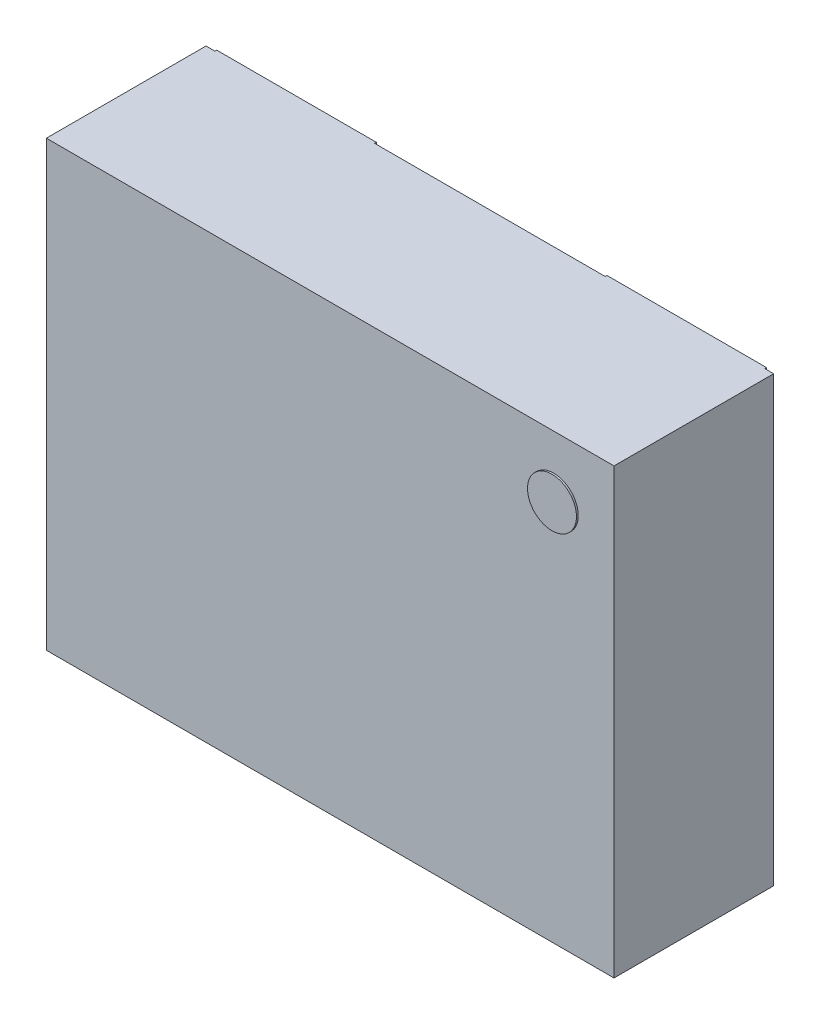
ISO-10303-21;
HEADER;
FILE_DESCRIPTION(('STEP AP214'),'2;1');
FILE_NAME('part.step','',(''),(''),'','','');
FILE_SCHEMA(('AUTOMOTIVE_DESIGN { 1 0 10303 214 1 1 1 1 }'));
ENDSEC;
DATA;
#1=APPLICATION_CONTEXT('core data for automotive mechanical design processes');
#2=APPLICATION_PROTOCOL_DEFINITION('international standard','automotive_design',2000,#1);
#3=PRODUCT_CONTEXT('',#1,'mechanical');
#4=PRODUCT('Part','Part','',(#3));
#5=PRODUCT_RELATED_PRODUCT_CATEGORY('part','',(#4));
#6=PRODUCT_DEFINITION_FORMATION('','',#4);
#7=PRODUCT_DEFINITION_CONTEXT('part definition',#1,'design');
#8=PRODUCT_DEFINITION('design','',#6,#7);
#9=PRODUCT_DEFINITION_SHAPE('','',#8);
#10=(LENGTH_UNIT() NAMED_UNIT(*) SI_UNIT(.MILLI.,.METRE.));
#11=(NAMED_UNIT(*) PLANE_ANGLE_UNIT() SI_UNIT($,.RADIAN.));
#12=(NAMED_UNIT(*) SI_UNIT($,.STERADIAN.) SOLID_ANGLE_UNIT());
#13=UNCERTAINTY_MEASURE_WITH_UNIT(LENGTH_MEASURE(1.E-05),#10,'distance_accuracy_value','');
#14=(GEOMETRIC_REPRESENTATION_CONTEXT(3) GLOBAL_UNCERTAINTY_ASSIGNED_CONTEXT((#13)) GLOBAL_UNIT_ASSIGNED_CONTEXT((#10,
#11,#12)) REPRESENTATION_CONTEXT('',''));
#15=CARTESIAN_POINT('',(0.,0.,0.));
#16=DIRECTION('',(0.,0.,1.));
#17=DIRECTION('',(1.,0.,0.));
#18=AXIS2_PLACEMENT_3D('',#15,#16,#17);
#19=CARTESIAN_POINT('',(7.35489990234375,20.14,-0.01));
#20=DIRECTION('',(0.,-1.,0.));
#21=DIRECTION('',(1.,0.,0.));
#22=AXIS2_PLACEMENT_3D('',#19,#20,#21);
#23=PLANE('',#22);
#24=DIRECTION('',(0.,0.,1.));
#25=VECTOR('',#24,1.);
#26=CARTESIAN_POINT('',(7.35489990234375,20.14,-0.0100000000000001));
#27=LINE('',#26,#25);
#28=CARTESIAN_POINT('',(7.35489990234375,20.14,0.));
#29=VERTEX_POINT('',#28);
#30=CARTESIAN_POINT('',(7.35489990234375,20.14,-0.01));
#31=VERTEX_POINT('',#30);
#32=EDGE_CURVE('E167',#29,#31,#27,.F.);
#33=ORIENTED_EDGE('',*,*,#32,.T.);
#34=DIRECTION('',(1.,0.,0.));
#35=VECTOR('',#34,1.);
#36=CARTESIAN_POINT('',(6.45489990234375,20.14,-0.0100000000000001));
#37=LINE('',#36,#35);
#38=CARTESIAN_POINT('',(6.45489990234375,20.14,-0.0100000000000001));
#39=VERTEX_POINT('',#38);
#40=EDGE_CURVE('E157',#39,#31,#37,.T.);
#41=ORIENTED_EDGE('',*,*,#40,.F.);
#42=DIRECTION('',(0.,0.,1.));
#43=VECTOR('',#42,1.);
#44=CARTESIAN_POINT('',(6.45489990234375,20.14,-0.0100000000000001));
#45=LINE('',#44,#43);
#46=CARTESIAN_POINT('',(6.45489990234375,20.14,0.));
#47=VERTEX_POINT('',#46);
#48=EDGE_CURVE('E180',#39,#47,#45,.T.);
#49=ORIENTED_EDGE('',*,*,#48,.T.);
#50=DIRECTION('',(1.,0.,0.));
#51=VECTOR('',#50,1.);
#52=CARTESIAN_POINT('',(7.40489990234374,20.14,0.));
#53=LINE('',#52,#51);
#54=EDGE_CURVE('E170',#29,#47,#53,.F.);
#55=ORIENTED_EDGE('',*,*,#54,.F.);
#56=EDGE_LOOP('',(#33,#41,#49,#55));
#57=FACE_BOUND('',#56,.T.);
#58=ADVANCED_FACE('F16',(#57),#23,.F.);
#59=CARTESIAN_POINT('',(4.25489990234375,20.14,-0.01));
#60=DIRECTION('',(0.,-1.,0.));
#61=DIRECTION('',(1.,0.,0.));
#62=AXIS2_PLACEMENT_3D('',#59,#60,#61);
#63=PLANE('',#62);
#64=DIRECTION('',(0.,0.,1.));
#65=VECTOR('',#64,1.);
#66=CARTESIAN_POINT('',(5.15489990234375,20.14,-0.0100000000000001));
#67=LINE('',#66,#65);
#68=CARTESIAN_POINT('',(5.15489990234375,20.14,0.));
#69=VERTEX_POINT('',#68);
#70=CARTESIAN_POINT('',(5.15489990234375,20.14,-0.01));
#71=VERTEX_POINT('',#70);
#72=EDGE_CURVE('E263',#69,#71,#67,.F.);
#73=ORIENTED_EDGE('',*,*,#72,.T.);
#74=DIRECTION('',(1.,0.,0.));
#75=VECTOR('',#74,1.);
#76=CARTESIAN_POINT('',(4.25489990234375,20.14,-0.01));
#77=LINE('',#76,#75);
#78=CARTESIAN_POINT('',(4.25489990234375,20.14,-0.01));
#79=VERTEX_POINT('',#78);
#80=EDGE_CURVE('E261',#79,#71,#77,.T.);
#81=ORIENTED_EDGE('',*,*,#80,.F.);
#82=DIRECTION('',(0.,0.,1.));
#83=VECTOR('',#82,1.);
#84=CARTESIAN_POINT('',(4.25489990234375,20.14,-0.0100000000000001));
#85=LINE('',#84,#83);
#86=CARTESIAN_POINT('',(4.25489990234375,20.14,0.));
#87=VERTEX_POINT('',#86);
#88=EDGE_CURVE('E253',#79,#87,#85,.T.);
#89=ORIENTED_EDGE('',*,*,#88,.T.);
#90=DIRECTION('',(1.,0.,0.));
#91=VECTOR('',#90,1.);
#92=CARTESIAN_POINT('',(7.40489990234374,20.14,0.));
#93=LINE('',#92,#91);
#94=EDGE_CURVE('E221',#69,#87,#93,.F.);
#95=ORIENTED_EDGE('',*,*,#94,.F.);
#96=EDGE_LOOP('',(#73,#81,#89,#95));
#97=FACE_BOUND('',#96,.T.);
#98=ADVANCED_FACE('F356',(#97),#63,.F.);
#99=CARTESIAN_POINT('',(4.25489990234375,21.04,-0.00999999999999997));
#100=DIRECTION('',(0.,1.,0.));
#101=DIRECTION('',(-1.,0.,0.));
#102=AXIS2_PLACEMENT_3D('',#99,#100,#101);
#103=PLANE('',#102);
#104=DIRECTION('',(0.,0.,1.));
#105=VECTOR('',#104,1.);
#106=CARTESIAN_POINT('',(4.25489990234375,21.04,-0.00999999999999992));
#107=LINE('',#106,#105);
#108=CARTESIAN_POINT('',(4.25489990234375,21.04,0.));
#109=VERTEX_POINT('',#108);
#110=CARTESIAN_POINT('',(4.25489990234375,21.04,-0.00999999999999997));
#111=VERTEX_POINT('',#110);
#112=EDGE_CURVE('E250',#109,#111,#107,.F.);
#113=ORIENTED_EDGE('',*,*,#112,.T.);
#114=DIRECTION('',(1.,0.,0.));
#115=VECTOR('',#114,1.);
#116=CARTESIAN_POINT('',(5.15489990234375,21.04,-0.00999999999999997));
#117=LINE('',#116,#115);
#118=CARTESIAN_POINT('',(5.15489990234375,21.04,-0.00999999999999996));
#119=VERTEX_POINT('',#118);
#120=EDGE_CURVE('E248',#119,#111,#117,.F.);
#121=ORIENTED_EDGE('',*,*,#120,.F.);
#122=DIRECTION('',(0.,0.,1.));
#123=VECTOR('',#122,1.);
#124=CARTESIAN_POINT('',(5.15489990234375,21.04,-0.00999999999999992));
#125=LINE('',#124,#123);
#126=CARTESIAN_POINT('',(5.15489990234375,21.04,0.));
#127=VERTEX_POINT('',#126);
#128=EDGE_CURVE('E240',#119,#127,#125,.T.);
#129=ORIENTED_EDGE('',*,*,#128,.T.);
#130=DIRECTION('',(1.,0.,0.));
#131=VECTOR('',#130,1.);
#132=CARTESIAN_POINT('',(7.40489990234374,21.04,0.));
#133=LINE('',#132,#131);
#134=EDGE_CURVE('E214',#109,#127,#133,.T.);
#135=ORIENTED_EDGE('',*,*,#134,.F.);
#136=EDGE_LOOP('',(#113,#121,#129,#135));
#137=FACE_BOUND('',#136,.T.);
#138=ADVANCED_FACE('F383',(#137),#103,.F.);
#139=CARTESIAN_POINT('',(6.90489990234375,21.04,-0.00999999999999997));
#140=DIRECTION('',(0.,1.,0.));
#141=DIRECTION('',(0.,0.,1.));
#142=AXIS2_PLACEMENT_3D('',#139,#140,#141);
#143=PLANE('',#142);
#144=DIRECTION('',(0.,0.,1.));
#145=VECTOR('',#144,1.);
#146=CARTESIAN_POINT('',(6.45489990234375,21.04,-0.00999999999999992));
#147=LINE('',#146,#145);
#148=CARTESIAN_POINT('',(6.45489990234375,21.04,0.));
#149=VERTEX_POINT('',#148);
#150=CARTESIAN_POINT('',(6.45489990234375,21.04,-0.00999999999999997));
#151=VERTEX_POINT('',#150);
#152=EDGE_CURVE('E238',#149,#151,#147,.F.);
#153=ORIENTED_EDGE('',*,*,#152,.T.);
#154=DIRECTION('',(1.,0.,0.));
#155=VECTOR('',#154,1.);
#156=CARTESIAN_POINT('',(7.35489990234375,21.04,-0.00999999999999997));
#157=LINE('',#156,#155);
#158=CARTESIAN_POINT('',(6.90489990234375,21.04,-0.00999999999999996));
#159=VERTEX_POINT('',#158);
#160=EDGE_CURVE('E192',#159,#151,#157,.F.);
#161=ORIENTED_EDGE('',*,*,#160,.F.);
#162=DIRECTION('',(0.,0.,1.));
#163=VECTOR('',#162,1.);
#164=CARTESIAN_POINT('',(6.90489990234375,21.04,-0.00999999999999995));
#165=LINE('',#164,#163);
#166=CARTESIAN_POINT('',(6.90489990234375,21.04,0.));
#167=VERTEX_POINT('',#166);
#168=EDGE_CURVE('E173',#159,#167,#165,.T.);
#169=ORIENTED_EDGE('',*,*,#168,.T.);
#170=DIRECTION('',(1.,0.,0.));
#171=VECTOR('',#170,1.);
#172=CARTESIAN_POINT('',(7.40489990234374,21.04,0.));
#173=LINE('',#172,#171);
#174=EDGE_CURVE('E191',#149,#167,#173,.T.);
#175=ORIENTED_EDGE('',*,*,#174,.F.);
#176=EDGE_LOOP('',(#153,#161,#169,#175));
#177=FACE_BOUND('',#176,.T.);
#178=ADVANCED_FACE('F190',(#177),#143,.F.);
#179=CARTESIAN_POINT('',(7.35489990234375,21.44,-0.00999999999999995));
#180=DIRECTION('',(-0.66436383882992,0.74740931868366,0.));
#181=DIRECTION('',(-0.74740931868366,-0.66436383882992,0.));
#182=AXIS2_PLACEMENT_3D('',#179,#180,#181);
#183=PLANE('',#182);
#184=ORIENTED_EDGE('',*,*,#168,.F.);
#185=DIRECTION('',(-0.747409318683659,-0.664363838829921,0.));
#186=VECTOR('',#185,1.);
#187=CARTESIAN_POINT('',(7.35489990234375,21.44,-0.00999999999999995));
#188=LINE('',#187,#186);
#189=CARTESIAN_POINT('',(7.35489990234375,21.44,-0.00999999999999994));
#190=VERTEX_POINT('',#189);
#191=EDGE_CURVE('E236',#190,#159,#188,.T.);
#192=ORIENTED_EDGE('',*,*,#191,.F.);
#193=DIRECTION('',(0.,0.,1.));
#194=VECTOR('',#193,1.);
#195=CARTESIAN_POINT('',(7.35489990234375,21.44,-0.00999999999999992));
#196=LINE('',#195,#194);
#197=CARTESIAN_POINT('',(7.35489990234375,21.44,0.));
#198=VERTEX_POINT('',#197);
#199=EDGE_CURVE('E199',#190,#198,#196,.T.);
#200=ORIENTED_EDGE('',*,*,#199,.T.);
#201=DIRECTION('',(0.747409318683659,0.664363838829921,0.));
#202=VECTOR('',#201,1.);
#203=CARTESIAN_POINT('',(6.90489990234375,21.04,0.));
#204=LINE('',#203,#202);
#205=EDGE_CURVE('E196',#167,#198,#204,.T.);
#206=ORIENTED_EDGE('',*,*,#205,.F.);
#207=EDGE_LOOP('',(#184,#192,#200,#206));
#208=FACE_BOUND('',#207,.T.);
#209=ADVANCED_FACE('F197',(#208),#183,.F.);
#210=CARTESIAN_POINT('',(7.35489990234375,19.34,-0.0100000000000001));
#211=DIRECTION('',(-1.,0.,0.));
#212=DIRECTION('',(0.,-1.,0.));
#213=AXIS2_PLACEMENT_3D('',#210,#211,#212);
#214=PLANE('',#213);
#215=DIRECTION('',(0.,0.,1.));
#216=VECTOR('',#215,1.);
#217=CARTESIAN_POINT('',(7.35489990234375,19.34,0.9));
#218=LINE('',#217,#216);
#219=CARTESIAN_POINT('',(7.35489990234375,19.34,0.));
#220=VERTEX_POINT('',#219);
#221=CARTESIAN_POINT('',(7.35489990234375,19.34,-0.0100000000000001));
#222=VERTEX_POINT('',#221);
#223=EDGE_CURVE('E178',#220,#222,#218,.F.);
#224=ORIENTED_EDGE('',*,*,#223,.T.);
#225=DIRECTION('',(0.,1.,0.));
#226=VECTOR('',#225,1.);
#227=CARTESIAN_POINT('',(7.35489990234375,19.34,-0.0100000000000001));
#228=LINE('',#227,#226);
#229=EDGE_CURVE('E164',#31,#222,#228,.F.);
#230=ORIENTED_EDGE('',*,*,#229,.F.);
#231=ORIENTED_EDGE('',*,*,#32,.F.);
#232=DIRECTION('',(0.,1.,0.));
#233=VECTOR('',#232,1.);
#234=CARTESIAN_POINT('',(7.35489990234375,21.84,0.));
#235=LINE('',#234,#233);
#236=EDGE_CURVE('E204',#220,#29,#235,.T.);
#237=ORIENTED_EDGE('',*,*,#236,.F.);
#238=EDGE_LOOP('',(#224,#230,#231,#237));
#239=FACE_BOUND('',#238,.T.);
#240=ADVANCED_FACE('F176',(#239),#214,.F.);
#241=CARTESIAN_POINT('',(6.45489990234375,19.34,-0.0100000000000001));
#242=DIRECTION('',(0.,0.,-1.));
#243=DIRECTION('',(0.,1.,0.));
#244=AXIS2_PLACEMENT_3D('',#241,#242,#243);
#245=PLANE('',#244);
#246=ORIENTED_EDGE('',*,*,#40,.T.);
#247=ORIENTED_EDGE('',*,*,#229,.T.);
#248=DIRECTION('',(-1.,0.,0.));
#249=VECTOR('',#248,1.);
#250=CARTESIAN_POINT('',(4.20489990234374,19.34,-0.0100000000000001));
#251=LINE('',#250,#249);
#252=CARTESIAN_POINT('',(6.45489990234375,19.34,-0.0100000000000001));
#253=VERTEX_POINT('',#252);
#254=EDGE_CURVE('E286',#222,#253,#251,.T.);
#255=ORIENTED_EDGE('',*,*,#254,.T.);
#256=DIRECTION('',(0.,1.,0.));
#257=VECTOR('',#256,1.);
#258=CARTESIAN_POINT('',(6.45489990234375,19.34,-0.0100000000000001));
#259=LINE('',#258,#257);
#260=EDGE_CURVE('E166',#253,#39,#259,.T.);
#261=ORIENTED_EDGE('',*,*,#260,.T.);
#262=EDGE_LOOP('',(#246,#247,#255,#261));
#263=FACE_BOUND('',#262,.T.);
#264=ADVANCED_FACE('F161',(#263),#245,.T.);
#265=CARTESIAN_POINT('',(6.45489990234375,19.34,-0.0100000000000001));
#266=DIRECTION('',(1.,0.,0.));
#267=DIRECTION('',(0.,1.,0.));
#268=AXIS2_PLACEMENT_3D('',#265,#266,#267);
#269=PLANE('',#268);
#270=ORIENTED_EDGE('',*,*,#48,.F.);
#271=ORIENTED_EDGE('',*,*,#260,.F.);
#272=DIRECTION('',(0.,0.,1.));
#273=VECTOR('',#272,1.);
#274=CARTESIAN_POINT('',(6.45489990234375,19.34,0.9));
#275=LINE('',#274,#273);
#276=CARTESIAN_POINT('',(6.45489990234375,19.34,0.));
#277=VERTEX_POINT('',#276);
#278=EDGE_CURVE('E270',#253,#277,#275,.T.);
#279=ORIENTED_EDGE('',*,*,#278,.T.);
#280=DIRECTION('',(0.,1.,0.));
#281=VECTOR('',#280,1.);
#282=CARTESIAN_POINT('',(6.45489990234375,21.84,0.));
#283=LINE('',#282,#281);
#284=EDGE_CURVE('E226',#47,#277,#283,.F.);
#285=ORIENTED_EDGE('',*,*,#284,.F.);
#286=EDGE_LOOP('',(#270,#271,#279,#285));
#287=FACE_BOUND('',#286,.T.);
#288=ADVANCED_FACE('F268',(#287),#269,.F.);
#289=CARTESIAN_POINT('',(5.15489990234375,19.34,-0.0100000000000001));
#290=DIRECTION('',(-1.,0.,0.));
#291=DIRECTION('',(0.,-1.,0.));
#292=AXIS2_PLACEMENT_3D('',#289,#290,#291);
#293=PLANE('',#292);
#294=DIRECTION('',(0.,0.,1.));
#295=VECTOR('',#294,1.);
#296=CARTESIAN_POINT('',(5.15489990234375,19.34,0.9));
#297=LINE('',#296,#295);
#298=CARTESIAN_POINT('',(5.15489990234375,19.34,0.));
#299=VERTEX_POINT('',#298);
#300=CARTESIAN_POINT('',(5.15489990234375,19.34,-0.01));
#301=VERTEX_POINT('',#300);
#302=EDGE_CURVE('E282',#299,#301,#297,.F.);
#303=ORIENTED_EDGE('',*,*,#302,.T.);
#304=DIRECTION('',(0.,1.,0.));
#305=VECTOR('',#304,1.);
#306=CARTESIAN_POINT('',(5.15489990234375,20.14,-0.01));
#307=LINE('',#306,#305);
#308=EDGE_CURVE('E259',#71,#301,#307,.F.);
#309=ORIENTED_EDGE('',*,*,#308,.F.);
#310=ORIENTED_EDGE('',*,*,#72,.F.);
#311=DIRECTION('',(0.,1.,0.));
#312=VECTOR('',#311,1.);
#313=CARTESIAN_POINT('',(5.15489990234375,21.84,0.));
#314=LINE('',#313,#312);
#315=EDGE_CURVE('E223',#299,#69,#314,.T.);
#316=ORIENTED_EDGE('',*,*,#315,.F.);
#317=EDGE_LOOP('',(#303,#309,#310,#316));
#318=FACE_BOUND('',#317,.T.);
#319=ADVANCED_FACE('F353',(#318),#293,.F.);
#320=CARTESIAN_POINT('',(4.25489990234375,20.14,-0.01));
#321=DIRECTION('',(0.,0.,-1.));
#322=DIRECTION('',(0.,1.,0.));
#323=AXIS2_PLACEMENT_3D('',#320,#321,#322);
#324=PLANE('',#323);
#325=ORIENTED_EDGE('',*,*,#308,.T.);
#326=DIRECTION('',(-1.,0.,0.));
#327=VECTOR('',#326,1.);
#328=CARTESIAN_POINT('',(4.20489990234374,19.34,-0.0100000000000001));
#329=LINE('',#328,#327);
#330=CARTESIAN_POINT('',(4.25489990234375,19.34,-0.0100000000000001));
#331=VERTEX_POINT('',#330);
#332=EDGE_CURVE('E284',#301,#331,#329,.T.);
#333=ORIENTED_EDGE('',*,*,#332,.T.);
#334=DIRECTION('',(0.,1.,0.));
#335=VECTOR('',#334,1.);
#336=CARTESIAN_POINT('',(4.25489990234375,19.34,-0.0100000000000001));
#337=LINE('',#336,#335);
#338=EDGE_CURVE('E256',#331,#79,#337,.T.);
#339=ORIENTED_EDGE('',*,*,#338,.T.);
#340=ORIENTED_EDGE('',*,*,#80,.T.);
#341=EDGE_LOOP('',(#325,#333,#339,#340));
#342=FACE_BOUND('',#341,.T.);
#343=ADVANCED_FACE('F349',(#342),#324,.T.);
#344=CARTESIAN_POINT('',(4.25489990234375,19.34,-0.0100000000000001));
#345=DIRECTION('',(1.,0.,0.));
#346=DIRECTION('',(0.,1.,0.));
#347=AXIS2_PLACEMENT_3D('',#344,#345,#346);
#348=PLANE('',#347);
#349=ORIENTED_EDGE('',*,*,#88,.F.);
#350=ORIENTED_EDGE('',*,*,#338,.F.);
#351=DIRECTION('',(0.,0.,1.));
#352=VECTOR('',#351,1.);
#353=CARTESIAN_POINT('',(4.25489990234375,19.34,0.9));
#354=LINE('',#353,#352);
#355=CARTESIAN_POINT('',(4.25489990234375,19.34,0.));
#356=VERTEX_POINT('',#355);
#357=EDGE_CURVE('E345',#331,#356,#354,.T.);
#358=ORIENTED_EDGE('',*,*,#357,.T.);
#359=DIRECTION('',(0.,1.,0.));
#360=VECTOR('',#359,1.);
#361=CARTESIAN_POINT('',(4.25489990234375,21.84,0.));
#362=LINE('',#361,#360);
#363=EDGE_CURVE('E219',#87,#356,#362,.F.);
#364=ORIENTED_EDGE('',*,*,#363,.F.);
#365=EDGE_LOOP('',(#349,#350,#358,#364));
#366=FACE_BOUND('',#365,.T.);
#367=ADVANCED_FACE('F360',(#366),#348,.F.);
#368=CARTESIAN_POINT('',(4.25489990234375,21.84,-0.00999999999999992));
#369=DIRECTION('',(1.,0.,0.));
#370=DIRECTION('',(0.,1.,0.));
#371=AXIS2_PLACEMENT_3D('',#368,#369,#370);
#372=PLANE('',#371);
#373=DIRECTION('',(0.,0.,1.));
#374=VECTOR('',#373,1.);
#375=CARTESIAN_POINT('',(4.25489990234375,21.84,0.9));
#376=LINE('',#375,#374);
#377=CARTESIAN_POINT('',(4.25489990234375,21.84,0.));
#378=VERTEX_POINT('',#377);
#379=CARTESIAN_POINT('',(4.25489990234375,21.84,-0.00999999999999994));
#380=VERTEX_POINT('',#379);
#381=EDGE_CURVE('E329',#378,#380,#376,.F.);
#382=ORIENTED_EDGE('',*,*,#381,.T.);
#383=DIRECTION('',(0.,1.,0.));
#384=VECTOR('',#383,1.);
#385=CARTESIAN_POINT('',(4.25489990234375,21.84,-0.00999999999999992));
#386=LINE('',#385,#384);
#387=EDGE_CURVE('E246',#111,#380,#386,.T.);
#388=ORIENTED_EDGE('',*,*,#387,.F.);
#389=ORIENTED_EDGE('',*,*,#112,.F.);
#390=DIRECTION('',(0.,1.,0.));
#391=VECTOR('',#390,1.);
#392=CARTESIAN_POINT('',(4.25489990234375,21.84,0.));
#393=LINE('',#392,#391);
#394=EDGE_CURVE('E216',#378,#109,#393,.F.);
#395=ORIENTED_EDGE('',*,*,#394,.F.);
#396=EDGE_LOOP('',(#382,#388,#389,#395));
#397=FACE_BOUND('',#396,.T.);
#398=ADVANCED_FACE('F570',(#397),#372,.F.);
#399=CARTESIAN_POINT('',(5.15489990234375,21.84,-0.00999999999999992));
#400=DIRECTION('',(0.,0.,-1.));
#401=DIRECTION('',(0.,1.,0.));
#402=AXIS2_PLACEMENT_3D('',#399,#400,#401);
#403=PLANE('',#402);
#404=ORIENTED_EDGE('',*,*,#120,.T.);
#405=ORIENTED_EDGE('',*,*,#387,.T.);
#406=DIRECTION('',(1.,0.,0.));
#407=VECTOR('',#406,1.);
#408=CARTESIAN_POINT('',(4.20489990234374,21.84,-0.00999999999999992));
#409=LINE('',#408,#407);
#410=CARTESIAN_POINT('',(5.15489990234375,21.84,-0.00999999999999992));
#411=VERTEX_POINT('',#410);
#412=EDGE_CURVE('E326',#380,#411,#409,.T.);
#413=ORIENTED_EDGE('',*,*,#412,.T.);
#414=DIRECTION('',(0.,-1.,0.));
#415=VECTOR('',#414,1.);
#416=CARTESIAN_POINT('',(5.15489990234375,21.84,-0.00999999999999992));
#417=LINE('',#416,#415);
#418=EDGE_CURVE('E243',#411,#119,#417,.T.);
#419=ORIENTED_EDGE('',*,*,#418,.T.);
#420=EDGE_LOOP('',(#404,#405,#413,#419));
#421=FACE_BOUND('',#420,.T.);
#422=ADVANCED_FACE('F580',(#421),#403,.T.);
#423=CARTESIAN_POINT('',(5.15489990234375,21.84,-0.00999999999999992));
#424=DIRECTION('',(-1.,0.,0.));
#425=DIRECTION('',(0.,-1.,0.));
#426=AXIS2_PLACEMENT_3D('',#423,#424,#425);
#427=PLANE('',#426);
#428=ORIENTED_EDGE('',*,*,#128,.F.);
#429=ORIENTED_EDGE('',*,*,#418,.F.);
#430=DIRECTION('',(0.,0.,1.));
#431=VECTOR('',#430,1.);
#432=CARTESIAN_POINT('',(5.15489990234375,21.84,0.9));
#433=LINE('',#432,#431);
#434=CARTESIAN_POINT('',(5.15489990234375,21.84,0.));
#435=VERTEX_POINT('',#434);
#436=EDGE_CURVE('E323',#411,#435,#433,.T.);
#437=ORIENTED_EDGE('',*,*,#436,.T.);
#438=DIRECTION('',(0.,1.,0.));
#439=VECTOR('',#438,1.);
#440=CARTESIAN_POINT('',(5.15489990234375,21.84,0.));
#441=LINE('',#440,#439);
#442=EDGE_CURVE('E212',#127,#435,#441,.T.);
#443=ORIENTED_EDGE('',*,*,#442,.F.);
#444=EDGE_LOOP('',(#428,#429,#437,#443));
#445=FACE_BOUND('',#444,.T.);
#446=ADVANCED_FACE('F388',(#445),#427,.F.);
#447=CARTESIAN_POINT('',(6.45489990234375,21.84,-0.00999999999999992));
#448=DIRECTION('',(1.,0.,0.));
#449=DIRECTION('',(0.,1.,0.));
#450=AXIS2_PLACEMENT_3D('',#447,#448,#449);
#451=PLANE('',#450);
#452=DIRECTION('',(0.,0.,1.));
#453=VECTOR('',#452,1.);
#454=CARTESIAN_POINT('',(6.45489990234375,21.84,0.9));
#455=LINE('',#454,#453);
#456=CARTESIAN_POINT('',(6.45489990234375,21.84,0.));
#457=VERTEX_POINT('',#456);
#458=CARTESIAN_POINT('',(6.45489990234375,21.84,-0.00999999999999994));
#459=VERTEX_POINT('',#458);
#460=EDGE_CURVE('E317',#457,#459,#455,.F.);
#461=ORIENTED_EDGE('',*,*,#460,.T.);
#462=DIRECTION('',(0.,1.,0.));
#463=VECTOR('',#462,1.);
#464=CARTESIAN_POINT('',(6.45489990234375,21.04,-0.00999999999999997));
#465=LINE('',#464,#463);
#466=EDGE_CURVE('E233',#151,#459,#465,.T.);
#467=ORIENTED_EDGE('',*,*,#466,.F.);
#468=ORIENTED_EDGE('',*,*,#152,.F.);
#469=DIRECTION('',(0.,1.,0.));
#470=VECTOR('',#469,1.);
#471=CARTESIAN_POINT('',(6.45489990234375,21.84,0.));
#472=LINE('',#471,#470);
#473=EDGE_CURVE('E206',#457,#149,#472,.F.);
#474=ORIENTED_EDGE('',*,*,#473,.F.);
#475=EDGE_LOOP('',(#461,#467,#468,#474));
#476=FACE_BOUND('',#475,.T.);
#477=ADVANCED_FACE('F395',(#476),#451,.F.);
#478=CARTESIAN_POINT('',(7.35489990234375,21.04,-0.00999999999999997));
#479=DIRECTION('',(0.,0.,-1.));
#480=DIRECTION('',(0.,1.,0.));
#481=AXIS2_PLACEMENT_3D('',#478,#479,#480);
#482=PLANE('',#481);
#483=ORIENTED_EDGE('',*,*,#466,.T.);
#484=DIRECTION('',(1.,0.,0.));
#485=VECTOR('',#484,1.);
#486=CARTESIAN_POINT('',(4.20489990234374,21.84,-0.00999999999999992));
#487=LINE('',#486,#485);
#488=CARTESIAN_POINT('',(7.35489990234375,21.84,-0.00999999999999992));
#489=VERTEX_POINT('',#488);
#490=EDGE_CURVE('E314',#459,#489,#487,.T.);
#491=ORIENTED_EDGE('',*,*,#490,.T.);
#492=DIRECTION('',(0.,-1.,0.));
#493=VECTOR('',#492,1.);
#494=CARTESIAN_POINT('',(7.35489990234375,21.84,-0.00999999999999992));
#495=LINE('',#494,#493);
#496=EDGE_CURVE('E230',#489,#190,#495,.T.);
#497=ORIENTED_EDGE('',*,*,#496,.T.);
#498=ORIENTED_EDGE('',*,*,#191,.T.);
#499=ORIENTED_EDGE('',*,*,#160,.T.);
#500=EDGE_LOOP('',(#483,#491,#497,#498,#499));
#501=FACE_BOUND('',#500,.T.);
#502=ADVANCED_FACE('F397',(#501),#482,.T.);
#503=CARTESIAN_POINT('',(7.35489990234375,21.84,-0.00999999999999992));
#504=DIRECTION('',(-1.,0.,0.));
#505=DIRECTION('',(0.,-1.,0.));
#506=AXIS2_PLACEMENT_3D('',#503,#504,#505);
#507=PLANE('',#506);
#508=ORIENTED_EDGE('',*,*,#199,.F.);
#509=ORIENTED_EDGE('',*,*,#496,.F.);
#510=DIRECTION('',(0.,0.,1.));
#511=VECTOR('',#510,1.);
#512=CARTESIAN_POINT('',(7.35489990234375,21.84,0.9));
#513=LINE('',#512,#511);
#514=CARTESIAN_POINT('',(7.35489990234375,21.84,0.));
#515=VERTEX_POINT('',#514);
#516=EDGE_CURVE('E311',#489,#515,#513,.T.);
#517=ORIENTED_EDGE('',*,*,#516,.T.);
#518=DIRECTION('',(0.,1.,0.));
#519=VECTOR('',#518,1.);
#520=CARTESIAN_POINT('',(7.35489990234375,21.84,0.));
#521=LINE('',#520,#519);
#522=EDGE_CURVE('E202',#198,#515,#521,.T.);
#523=ORIENTED_EDGE('',*,*,#522,.F.);
#524=EDGE_LOOP('',(#508,#509,#517,#523));
#525=FACE_BOUND('',#524,.T.);
#526=ADVANCED_FACE('F399',(#525),#507,.F.);
#527=CARTESIAN_POINT('',(7.40489990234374,21.84,0.));
#528=DIRECTION('',(0.,0.,-1.));
#529=DIRECTION('',(0.,1.,0.));
#530=AXIS2_PLACEMENT_3D('',#527,#528,#529);
#531=PLANE('',#530);
#532=DIRECTION('',(-1.,0.,0.));
#533=VECTOR('',#532,1.);
#534=CARTESIAN_POINT('',(4.20489990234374,19.34,0.));
#535=LINE('',#534,#533);
#536=CARTESIAN_POINT('',(7.40489990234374,19.34,0.));
#537=VERTEX_POINT('',#536);
#538=EDGE_CURVE('E292',#537,#220,#535,.T.);
#539=ORIENTED_EDGE('',*,*,#538,.T.);
#540=ORIENTED_EDGE('',*,*,#236,.T.);
#541=ORIENTED_EDGE('',*,*,#54,.T.);
#542=ORIENTED_EDGE('',*,*,#284,.T.);
#543=DIRECTION('',(-1.,0.,0.));
#544=VECTOR('',#543,1.);
#545=CARTESIAN_POINT('',(4.20489990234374,19.34,0.));
#546=LINE('',#545,#544);
#547=EDGE_CURVE('E275',#277,#299,#546,.T.);
#548=ORIENTED_EDGE('',*,*,#547,.T.);
#549=ORIENTED_EDGE('',*,*,#315,.T.);
#550=ORIENTED_EDGE('',*,*,#94,.T.);
#551=ORIENTED_EDGE('',*,*,#363,.T.);
#552=DIRECTION('',(-1.,0.,0.));
#553=VECTOR('',#552,1.);
#554=CARTESIAN_POINT('',(4.20489990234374,19.34,0.));
#555=LINE('',#554,#553);
#556=CARTESIAN_POINT('',(4.20489990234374,19.34,0.));
#557=VERTEX_POINT('',#556);
#558=EDGE_CURVE('E343',#356,#557,#555,.T.);
#559=ORIENTED_EDGE('',*,*,#558,.T.);
#560=DIRECTION('',(0.,1.,0.));
#561=VECTOR('',#560,1.);
#562=CARTESIAN_POINT('',(4.20489990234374,19.34,0.));
#563=LINE('',#562,#561);
#564=CARTESIAN_POINT('',(4.20489990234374,21.84,0.));
#565=VERTEX_POINT('',#564);
#566=EDGE_CURVE('E338',#557,#565,#563,.T.);
#567=ORIENTED_EDGE('',*,*,#566,.T.);
#568=DIRECTION('',(1.,0.,0.));
#569=VECTOR('',#568,1.);
#570=CARTESIAN_POINT('',(4.20489990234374,21.84,0.));
#571=LINE('',#570,#569);
#572=EDGE_CURVE('E332',#565,#378,#571,.T.);
#573=ORIENTED_EDGE('',*,*,#572,.T.);
#574=ORIENTED_EDGE('',*,*,#394,.T.);
#575=ORIENTED_EDGE('',*,*,#134,.T.);
#576=ORIENTED_EDGE('',*,*,#442,.T.);
#577=DIRECTION('',(1.,0.,0.));
#578=VECTOR('',#577,1.);
#579=CARTESIAN_POINT('',(4.20489990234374,21.84,0.));
#580=LINE('',#579,#578);
#581=EDGE_CURVE('E320',#435,#457,#580,.T.);
#582=ORIENTED_EDGE('',*,*,#581,.T.);
#583=ORIENTED_EDGE('',*,*,#473,.T.);
#584=ORIENTED_EDGE('',*,*,#174,.T.);
#585=ORIENTED_EDGE('',*,*,#205,.T.);
#586=ORIENTED_EDGE('',*,*,#522,.T.);
#587=DIRECTION('',(1.,0.,0.));
#588=VECTOR('',#587,1.);
#589=CARTESIAN_POINT('',(4.20489990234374,21.84,0.));
#590=LINE('',#589,#588);
#591=CARTESIAN_POINT('',(7.40489990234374,21.84,0.));
#592=VERTEX_POINT('',#591);
#593=EDGE_CURVE('E300',#515,#592,#590,.T.);
#594=ORIENTED_EDGE('',*,*,#593,.T.);
#595=DIRECTION('',(0.,-1.,0.));
#596=VECTOR('',#595,1.);
#597=CARTESIAN_POINT('',(7.40489990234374,19.34,0.));
#598=LINE('',#597,#596);
#599=EDGE_CURVE('E299',#592,#537,#598,.T.);
#600=ORIENTED_EDGE('',*,*,#599,.T.);
#601=EDGE_LOOP('',(#539,#540,#541,#542,#548,#549,#550,#551,#559,#567,#573,#574,#575,#576,#582,
#583,#584,#585,#586,#594,#600));
#602=FACE_BOUND('',#601,.T.);
#603=ADVANCED_FACE('F274',(#602),#531,.T.);
#604=CARTESIAN_POINT('',(7.06534117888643,21.4966894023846,0.91));
#605=DIRECTION('',(0.,0.,1.));
#606=DIRECTION('',(0.,-1.,0.));
#607=AXIS2_PLACEMENT_3D('',#604,#605,#606);
#608=PLANE('',#607);
#609=CARTESIAN_POINT('',(7.06534117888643,21.4966894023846,0.91));
#610=DIRECTION('',(0.,0.,1.));
#611=DIRECTION('',(0.,-1.,0.));
#612=AXIS2_PLACEMENT_3D('',#609,#610,#611);
#613=CIRCLE('',#612,0.137986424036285);
#614=CARTESIAN_POINT('',(7.06534117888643,21.3587029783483,0.91));
#615=VERTEX_POINT('',#614);
#616=EDGE_CURVE('E19',#615,#615,#613,.F.);
#617=ORIENTED_EDGE('',*,*,#616,.F.);
#618=EDGE_LOOP('',(#617));
#619=FACE_BOUND('',#618,.T.);
#620=ADVANCED_FACE('F407',(#619),#608,.T.);
#621=CARTESIAN_POINT('',(4.20489990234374,19.34,0.9));
#622=DIRECTION('',(0.,1.,0.));
#623=DIRECTION('',(-1.,0.,0.));
#624=AXIS2_PLACEMENT_3D('',#621,#622,#623);
#625=PLANE('',#624);
#626=ORIENTED_EDGE('',*,*,#357,.F.);
#627=ORIENTED_EDGE('',*,*,#332,.F.);
#628=ORIENTED_EDGE('',*,*,#302,.F.);
#629=ORIENTED_EDGE('',*,*,#547,.F.);
#630=ORIENTED_EDGE('',*,*,#278,.F.);
#631=ORIENTED_EDGE('',*,*,#254,.F.);
#632=ORIENTED_EDGE('',*,*,#223,.F.);
#633=ORIENTED_EDGE('',*,*,#538,.F.);
#634=DIRECTION('',(0.,0.,1.));
#635=VECTOR('',#634,1.);
#636=CARTESIAN_POINT('',(7.40489990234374,19.34,0.9));
#637=LINE('',#636,#635);
#638=CARTESIAN_POINT('',(7.40489990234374,19.34,0.9));
#639=VERTEX_POINT('',#638);
#640=EDGE_CURVE('E297',#537,#639,#637,.T.);
#641=ORIENTED_EDGE('',*,*,#640,.T.);
#642=DIRECTION('',(1.,0.,0.));
#643=VECTOR('',#642,1.);
#644=CARTESIAN_POINT('',(7.40489990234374,19.34,0.9));
#645=LINE('',#644,#643);
#646=CARTESIAN_POINT('',(4.20489990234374,19.34,0.9));
#647=VERTEX_POINT('',#646);
#648=EDGE_CURVE('E305',#639,#647,#645,.F.);
#649=ORIENTED_EDGE('',*,*,#648,.T.);
#650=DIRECTION('',(0.,0.,1.));
#651=VECTOR('',#650,1.);
#652=CARTESIAN_POINT('',(4.20489990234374,19.34,0.9));
#653=LINE('',#652,#651);
#654=EDGE_CURVE('E340',#647,#557,#653,.F.);
#655=ORIENTED_EDGE('',*,*,#654,.T.);
#656=ORIENTED_EDGE('',*,*,#558,.F.);
#657=EDGE_LOOP('',(#626,#627,#628,#629,#630,#631,#632,#633,#641,#649,#655,#656));
#658=FACE_BOUND('',#657,.T.);
#659=ADVANCED_FACE('F279',(#658),#625,.F.);
#660=CARTESIAN_POINT('',(4.20489990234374,19.34,0.9));
#661=DIRECTION('',(1.,0.,0.));
#662=DIRECTION('',(0.,1.,0.));
#663=AXIS2_PLACEMENT_3D('',#660,#661,#662);
#664=PLANE('',#663);
#665=ORIENTED_EDGE('',*,*,#654,.F.);
#666=DIRECTION('',(0.,1.,0.));
#667=VECTOR('',#666,1.);
#668=CARTESIAN_POINT('',(4.20489990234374,21.84,0.9));
#669=LINE('',#668,#667);
#670=CARTESIAN_POINT('',(4.20489990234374,21.84,0.9));
#671=VERTEX_POINT('',#670);
#672=EDGE_CURVE('E366',#647,#671,#669,.T.);
#673=ORIENTED_EDGE('',*,*,#672,.T.);
#674=DIRECTION('',(0.,0.,1.));
#675=VECTOR('',#674,1.);
#676=CARTESIAN_POINT('',(4.20489990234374,21.84,0.9));
#677=LINE('',#676,#675);
#678=EDGE_CURVE('E335',#671,#565,#677,.F.);
#679=ORIENTED_EDGE('',*,*,#678,.T.);
#680=ORIENTED_EDGE('',*,*,#566,.F.);
#681=EDGE_LOOP('',(#665,#673,#679,#680));
#682=FACE_BOUND('',#681,.T.);
#683=ADVANCED_FACE('F365',(#682),#664,.F.);
#684=CARTESIAN_POINT('',(4.20489990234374,21.84,0.9));
#685=DIRECTION('',(0.,-1.,0.));
#686=DIRECTION('',(1.,0.,0.));
#687=AXIS2_PLACEMENT_3D('',#684,#685,#686);
#688=PLANE('',#687);
#689=ORIENTED_EDGE('',*,*,#516,.F.);
#690=ORIENTED_EDGE('',*,*,#490,.F.);
#691=ORIENTED_EDGE('',*,*,#460,.F.);
#692=ORIENTED_EDGE('',*,*,#581,.F.);
#693=ORIENTED_EDGE('',*,*,#436,.F.);
#694=ORIENTED_EDGE('',*,*,#412,.F.);
#695=ORIENTED_EDGE('',*,*,#381,.F.);
#696=ORIENTED_EDGE('',*,*,#572,.F.);
#697=ORIENTED_EDGE('',*,*,#678,.F.);
#698=DIRECTION('',(1.,0.,0.));
#699=VECTOR('',#698,1.);
#700=CARTESIAN_POINT('',(7.40489990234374,21.84,0.9));
#701=LINE('',#700,#699);
#702=CARTESIAN_POINT('',(7.40489990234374,21.84,0.9));
#703=VERTEX_POINT('',#702);
#704=EDGE_CURVE('E371',#671,#703,#701,.T.);
#705=ORIENTED_EDGE('',*,*,#704,.T.);
#706=DIRECTION('',(0.,0.,1.));
#707=VECTOR('',#706,1.);
#708=CARTESIAN_POINT('',(7.40489990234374,21.84,0.9));
#709=LINE('',#708,#707);
#710=EDGE_CURVE('E33',#703,#592,#709,.F.);
#711=ORIENTED_EDGE('',*,*,#710,.T.);
#712=ORIENTED_EDGE('',*,*,#593,.F.);
#713=EDGE_LOOP('',(#689,#690,#691,#692,#693,#694,#695,#696,#697,#705,#711,#712));
#714=FACE_BOUND('',#713,.T.);
#715=ADVANCED_FACE('F376',(#714),#688,.F.);
#716=CARTESIAN_POINT('',(7.40489990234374,19.34,0.9));
#717=DIRECTION('',(-1.,0.,0.));
#718=DIRECTION('',(0.,-1.,0.));
#719=AXIS2_PLACEMENT_3D('',#716,#717,#718);
#720=PLANE('',#719);
#721=ORIENTED_EDGE('',*,*,#710,.F.);
#722=DIRECTION('',(0.,1.,0.));
#723=VECTOR('',#722,1.);
#724=CARTESIAN_POINT('',(7.40489990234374,21.84,0.9));
#725=LINE('',#724,#723);
#726=EDGE_CURVE('E25',#703,#639,#725,.F.);
#727=ORIENTED_EDGE('',*,*,#726,.T.);
#728=ORIENTED_EDGE('',*,*,#640,.F.);
#729=ORIENTED_EDGE('',*,*,#599,.F.);
#730=EDGE_LOOP('',(#721,#727,#728,#729));
#731=FACE_BOUND('',#730,.T.);
#732=ADVANCED_FACE('F298',(#731),#720,.F.);
#733=CARTESIAN_POINT('',(7.06534117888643,21.4966894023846,0.91));
#734=DIRECTION('',(0.,0.,1.));
#735=DIRECTION('',(0.,-1.,0.));
#736=AXIS2_PLACEMENT_3D('',#733,#734,#735);
#737=CYLINDRICAL_SURFACE('',#736,0.137986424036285);
#738=CARTESIAN_POINT('',(7.06534117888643,21.4966894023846,0.9));
#739=DIRECTION('',(0.,0.,1.));
#740=DIRECTION('',(0.,-1.,0.));
#741=AXIS2_PLACEMENT_3D('',#738,#739,#740);
#742=CIRCLE('',#741,0.137986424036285);
#743=CARTESIAN_POINT('',(7.06534117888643,21.3587029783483,0.9));
#744=VERTEX_POINT('',#743);
#745=EDGE_CURVE('E10',#744,#744,#742,.T.);
#746=ORIENTED_EDGE('',*,*,#745,.T.);
#747=EDGE_LOOP('',(#746));
#748=FACE_BOUND('',#747,.T.);
#749=ORIENTED_EDGE('',*,*,#616,.T.);
#750=EDGE_LOOP('',(#749));
#751=FACE_BOUND('',#750,.T.);
#752=ADVANCED_FACE('F411',(#748,#751),#737,.T.);
#753=CARTESIAN_POINT('',(7.40489990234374,21.84,0.9));
#754=DIRECTION('',(0.,0.,-1.));
#755=DIRECTION('',(0.,1.,0.));
#756=AXIS2_PLACEMENT_3D('',#753,#754,#755);
#757=PLANE('',#756);
#758=ORIENTED_EDGE('',*,*,#745,.F.);
#759=EDGE_LOOP('',(#758));
#760=FACE_BOUND('',#759,.T.);
#761=ORIENTED_EDGE('',*,*,#704,.F.);
#762=ORIENTED_EDGE('',*,*,#672,.F.);
#763=ORIENTED_EDGE('',*,*,#648,.F.);
#764=ORIENTED_EDGE('',*,*,#726,.F.);
#765=EDGE_LOOP('',(#761,#762,#763,#764));
#766=FACE_BOUND('',#765,.T.);
#767=ADVANCED_FACE('F369',(#760,#766),#757,.F.);
#768=CLOSED_SHELL('',(#58,#98,#138,#178,#209,#240,#264,#288,#319,#343,#367,#398,#422,#446,#477,
#502,#526,#603,#620,#659,#683,#715,#732,#752,#767));
#769=MANIFOLD_SOLID_BREP('B1',#768);
#770=ADVANCED_BREP_SHAPE_REPRESENTATION('',(#18,#769),#14);
#771=SHAPE_DEFINITION_REPRESENTATION(#9,#770);
ENDSEC;
END-ISO-10303-21;
